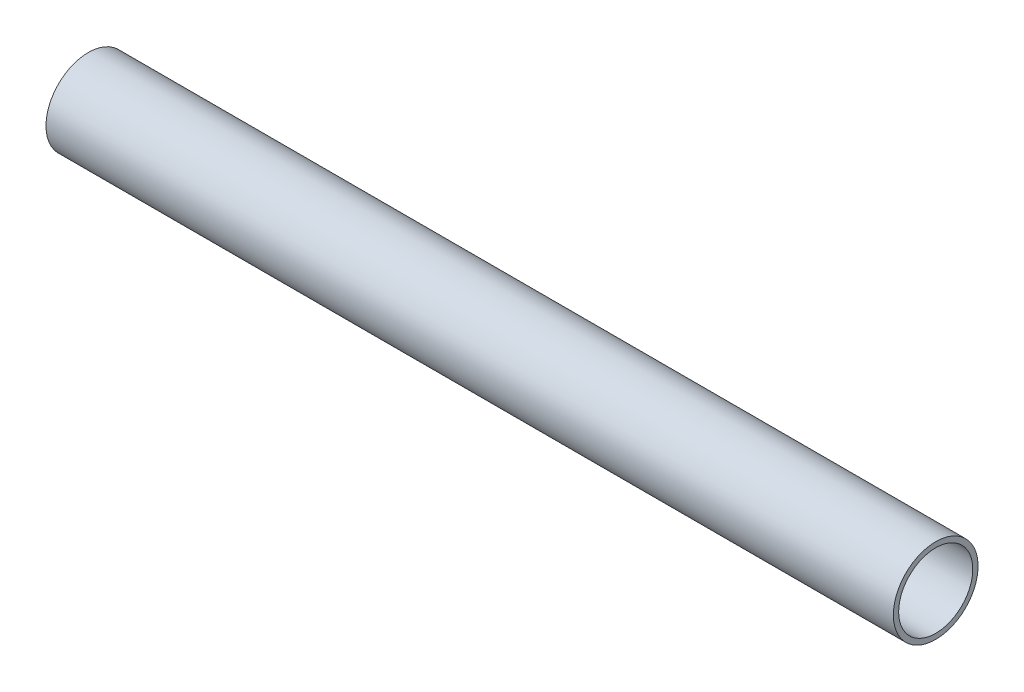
from build123d import *

# Parameters (mm, degrees)
ESQUISSE1_W = 160
ESQUISSE1_H = 1


with BuildPart() as part:
    # Esquisse1 → Base-R_volution (revolve)
    with BuildSketch(Plane.XY, mode=Mode.PRIVATE) as base_r_volution_sk:
        with Locations((80, 7.5)):
            Rectangle(ESQUISSE1_W, ESQUISSE1_H)
    revolve(base_r_volution_sk.sketch.rotate(Axis((0, 0, 0), (1, 0, 0)), 90), axis=Axis((0, 0, 0), (1, 0, 0)))


solid = part.part
